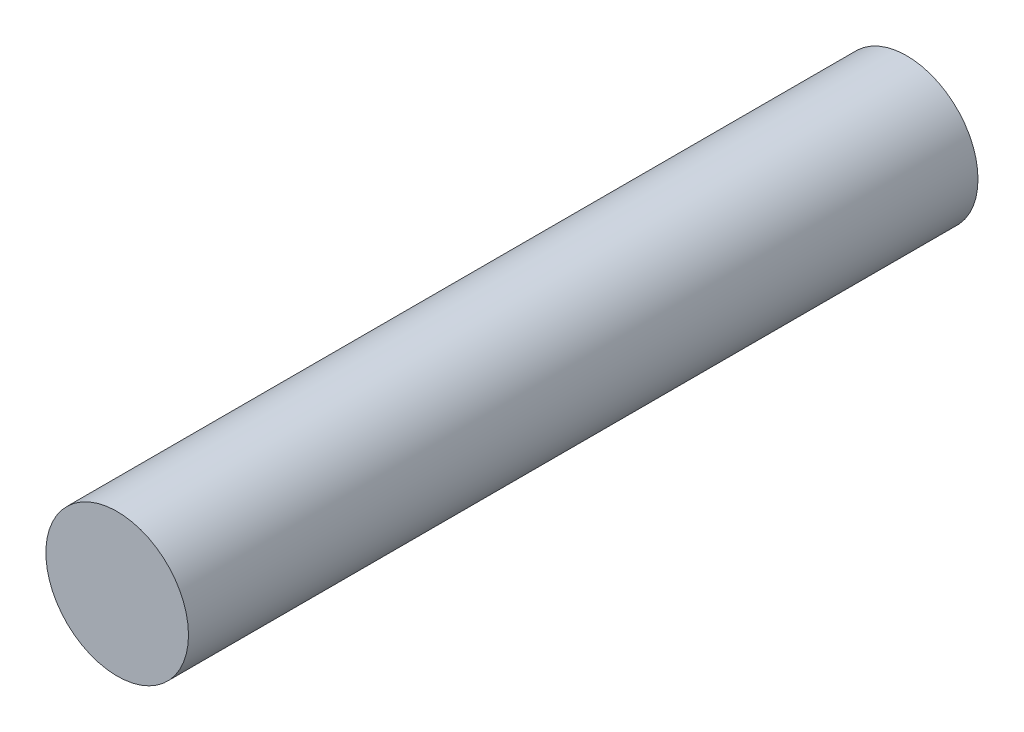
from build123d import *

# Parameters (mm, degrees)
ESQUISSE1_R        = 14
BOSS_EXTRU_1_DEPTH = 155


with BuildPart() as part:
    # Esquisse1 → Boss.-Extru.1 (new body)
    with BuildSketch(Plane.XY):
        Circle(ESQUISSE1_R)
    extrude(amount=BOSS_EXTRU_1_DEPTH)


solid = part.part
